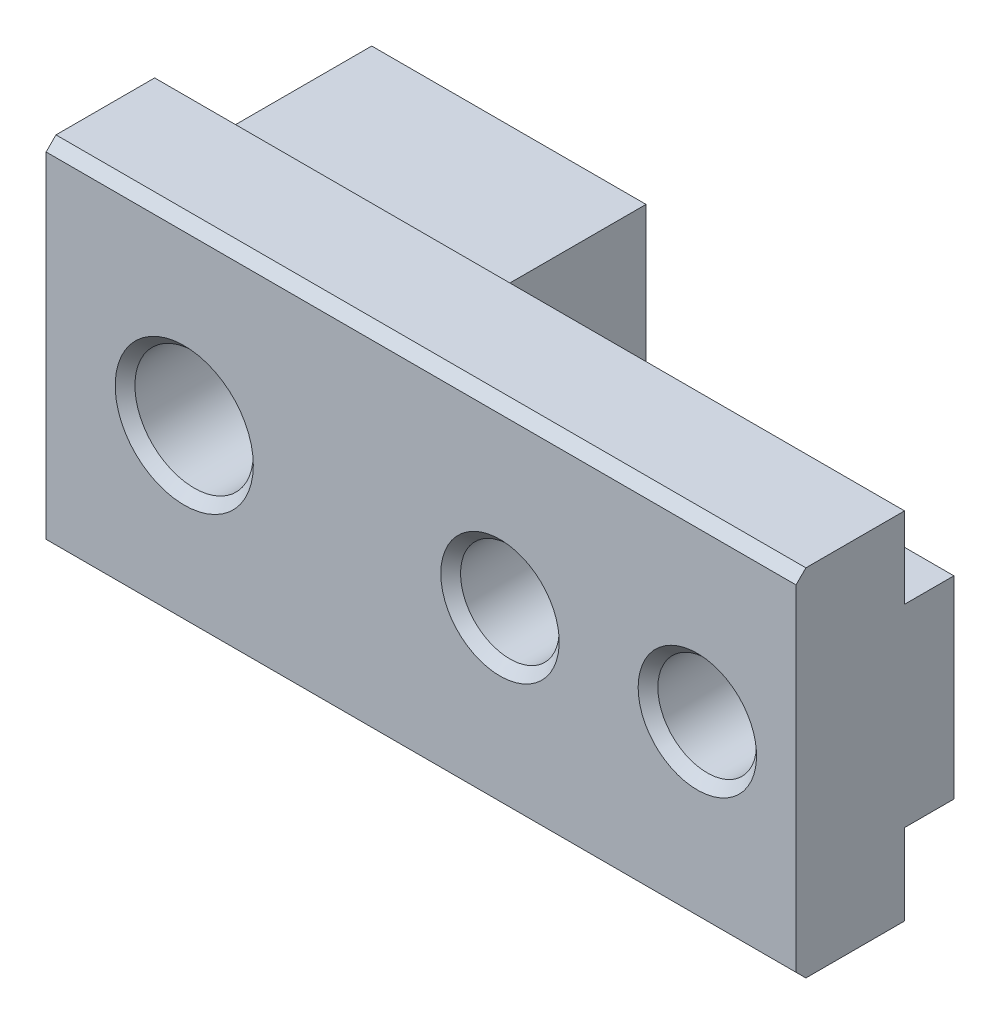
ISO-10303-21;
HEADER;
FILE_DESCRIPTION(('STEP AP214'),'2;1');
FILE_NAME('part.step','',(''),(''),'','','');
FILE_SCHEMA(('AUTOMOTIVE_DESIGN { 1 0 10303 214 1 1 1 1 }'));
ENDSEC;
DATA;
#1=APPLICATION_CONTEXT('core data for automotive mechanical design processes');
#2=APPLICATION_PROTOCOL_DEFINITION('international standard','automotive_design',2000,#1);
#3=PRODUCT_CONTEXT('',#1,'mechanical');
#4=PRODUCT('Part','Part','',(#3));
#5=PRODUCT_RELATED_PRODUCT_CATEGORY('part','',(#4));
#6=PRODUCT_DEFINITION_FORMATION('','',#4);
#7=PRODUCT_DEFINITION_CONTEXT('part definition',#1,'design');
#8=PRODUCT_DEFINITION('design','',#6,#7);
#9=PRODUCT_DEFINITION_SHAPE('','',#8);
#10=(LENGTH_UNIT() NAMED_UNIT(*) SI_UNIT(.MILLI.,.METRE.));
#11=(NAMED_UNIT(*) PLANE_ANGLE_UNIT() SI_UNIT($,.RADIAN.));
#12=(NAMED_UNIT(*) SI_UNIT($,.STERADIAN.) SOLID_ANGLE_UNIT());
#13=UNCERTAINTY_MEASURE_WITH_UNIT(LENGTH_MEASURE(1.E-05),#10,'distance_accuracy_value','');
#14=(GEOMETRIC_REPRESENTATION_CONTEXT(3) GLOBAL_UNCERTAINTY_ASSIGNED_CONTEXT((#13)) GLOBAL_UNIT_ASSIGNED_CONTEXT((#10,
#11,#12)) REPRESENTATION_CONTEXT('',''));
#15=CARTESIAN_POINT('',(0.,0.,0.));
#16=DIRECTION('',(0.,0.,1.));
#17=DIRECTION('',(1.,0.,0.));
#18=AXIS2_PLACEMENT_3D('',#15,#16,#17);
#19=CARTESIAN_POINT('',(0.,0.,-10.9999999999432));
#20=DIRECTION('',(0.,0.,-1.));
#21=DIRECTION('',(-1.,0.,0.));
#22=AXIS2_PLACEMENT_3D('',#19,#20,#21);
#23=CONICAL_SURFACE('',#22,3.49999999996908,0.785398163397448);
#24=CARTESIAN_POINT('',(0.,0.,-11.0000000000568));
#25=DIRECTION('',(0.,0.,-1.));
#26=DIRECTION('',(-1.,0.,0.));
#27=AXIS2_PLACEMENT_3D('',#24,#25,#26);
#28=CIRCLE('',#27,3.50000000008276);
#29=CARTESIAN_POINT('',(-3.50000000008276,0.,-11.0000000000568));
#30=VERTEX_POINT('',#29);
#31=EDGE_CURVE('E178',#30,#30,#28,.T.);
#32=ORIENTED_EDGE('',*,*,#31,.T.);
#33=EDGE_LOOP('',(#32));
#34=FACE_BOUND('',#33,.T.);
#35=CARTESIAN_POINT('',(0.,0.,-10.5));
#36=DIRECTION('',(0.,0.,1.));
#37=DIRECTION('',(1.,0.,0.));
#38=AXIS2_PLACEMENT_3D('',#35,#36,#37);
#39=CIRCLE('',#38,3.);
#40=CARTESIAN_POINT('',(3.,0.,-10.5));
#41=VERTEX_POINT('',#40);
#42=EDGE_CURVE('E151',#41,#41,#39,.T.);
#43=ORIENTED_EDGE('',*,*,#42,.T.);
#44=EDGE_LOOP('',(#43));
#45=FACE_BOUND('',#44,.T.);
#46=ADVANCED_FACE('F14',(#34,#45),#23,.F.);
#47=CARTESIAN_POINT('',(0.,0.,-11.));
#48=DIRECTION('',(0.,0.,1.));
#49=DIRECTION('',(1.,0.,0.));
#50=AXIS2_PLACEMENT_3D('',#47,#48,#49);
#51=CYLINDRICAL_SURFACE('',#50,3.);
#52=CARTESIAN_POINT('',(0.,0.,5.00000000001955));
#53=DIRECTION('',(0.,0.,1.));
#54=DIRECTION('',(1.,0.,0.));
#55=AXIS2_PLACEMENT_3D('',#52,#53,#54);
#56=CIRCLE('',#55,3.00000000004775);
#57=CARTESIAN_POINT('',(3.00000000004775,0.,5.00000000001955));
#58=VERTEX_POINT('',#57);
#59=EDGE_CURVE('E163',#58,#58,#56,.T.);
#60=ORIENTED_EDGE('',*,*,#59,.T.);
#61=EDGE_LOOP('',(#60));
#62=FACE_BOUND('',#61,.T.);
#63=ORIENTED_EDGE('',*,*,#42,.F.);
#64=EDGE_LOOP('',(#63));
#65=FACE_BOUND('',#64,.T.);
#66=ADVANCED_FACE('F316',(#62,#65),#51,.F.);
#67=CARTESIAN_POINT('',(7.1,-4.9,-11.));
#68=DIRECTION('',(0.,0.,1.));
#69=DIRECTION('',(1.,0.,0.));
#70=AXIS2_PLACEMENT_3D('',#67,#68,#69);
#71=PLANE('',#70);
#72=DIRECTION('',(1.,0.,0.));
#73=VECTOR('',#72,1.);
#74=CARTESIAN_POINT('',(7.1,4.9,-11.));
#75=LINE('',#74,#73);
#76=CARTESIAN_POINT('',(-7.,4.9,-11.));
#77=VERTEX_POINT('',#76);
#78=CARTESIAN_POINT('',(6.9,4.9,-11.));
#79=VERTEX_POINT('',#78);
#80=EDGE_CURVE('E169',#77,#79,#75,.T.);
#81=ORIENTED_EDGE('',*,*,#80,.T.);
#82=DIRECTION('',(0.,1.,0.));
#83=VECTOR('',#82,1.);
#84=CARTESIAN_POINT('',(6.9,11.9672645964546,-11.));
#85=LINE('',#84,#83);
#86=CARTESIAN_POINT('',(6.9,-4.9,-11.));
#87=VERTEX_POINT('',#86);
#88=EDGE_CURVE('E131',#87,#79,#85,.T.);
#89=ORIENTED_EDGE('',*,*,#88,.F.);
#90=DIRECTION('',(-1.,0.,0.));
#91=VECTOR('',#90,1.);
#92=CARTESIAN_POINT('',(7.1,-4.9,-11.));
#93=LINE('',#92,#91);
#94=CARTESIAN_POINT('',(-7.,-4.9,-11.));
#95=VERTEX_POINT('',#94);
#96=EDGE_CURVE('E174',#87,#95,#93,.T.);
#97=ORIENTED_EDGE('',*,*,#96,.T.);
#98=DIRECTION('',(0.,-1.,0.));
#99=VECTOR('',#98,1.);
#100=CARTESIAN_POINT('',(-7.,-4.9,-11.));
#101=LINE('',#100,#99);
#102=EDGE_CURVE('E156',#77,#95,#101,.T.);
#103=ORIENTED_EDGE('',*,*,#102,.F.);
#104=EDGE_LOOP('',(#81,#89,#97,#103));
#105=FACE_BOUND('',#104,.T.);
#106=ORIENTED_EDGE('',*,*,#31,.F.);
#107=EDGE_LOOP('',(#106));
#108=FACE_BOUND('',#107,.T.);
#109=ADVANCED_FACE('F258',(#105,#108),#71,.F.);
#110=CARTESIAN_POINT('',(7.1,-9.05,0.));
#111=DIRECTION('',(0.,0.,1.));
#112=DIRECTION('',(1.,0.,0.));
#113=AXIS2_PLACEMENT_3D('',#110,#111,#112);
#114=PLANE('',#113);
#115=DIRECTION('',(0.,-1.,0.));
#116=VECTOR('',#115,1.);
#117=CARTESIAN_POINT('',(31.,-9.05,0.));
#118=LINE('',#117,#116);
#119=CARTESIAN_POINT('',(31.,-4.9,0.));
#120=VERTEX_POINT('',#119);
#121=CARTESIAN_POINT('',(31.,-9.,0.));
#122=VERTEX_POINT('',#121);
#123=EDGE_CURVE('E123',#120,#122,#118,.T.);
#124=ORIENTED_EDGE('',*,*,#123,.T.);
#125=DIRECTION('',(-1.,0.,0.));
#126=VECTOR('',#125,1.);
#127=CARTESIAN_POINT('',(7.1,-9.,0.));
#128=LINE('',#127,#126);
#129=CARTESIAN_POINT('',(-7.,-9.,0.));
#130=VERTEX_POINT('',#129);
#131=EDGE_CURVE('E119',#122,#130,#128,.T.);
#132=ORIENTED_EDGE('',*,*,#131,.T.);
#133=DIRECTION('',(0.,-1.,0.));
#134=VECTOR('',#133,1.);
#135=CARTESIAN_POINT('',(-7.,-4.9,0.));
#136=LINE('',#135,#134);
#137=CARTESIAN_POINT('',(-7.,-4.9,0.));
#138=VERTEX_POINT('',#137);
#139=EDGE_CURVE('E105',#138,#130,#136,.T.);
#140=ORIENTED_EDGE('',*,*,#139,.F.);
#141=DIRECTION('',(-1.,0.,0.));
#142=VECTOR('',#141,1.);
#143=CARTESIAN_POINT('',(7.1,-4.9,0.));
#144=LINE('',#143,#142);
#145=EDGE_CURVE('E176',#138,#120,#144,.F.);
#146=ORIENTED_EDGE('',*,*,#145,.T.);
#147=EDGE_LOOP('',(#124,#132,#140,#146));
#148=FACE_BOUND('',#147,.T.);
#149=ADVANCED_FACE('F122',(#148),#114,.F.);
#150=CARTESIAN_POINT('',(7.1,-4.9,-11.));
#151=DIRECTION('',(0.,1.,0.));
#152=DIRECTION('',(-1.,0.,0.));
#153=AXIS2_PLACEMENT_3D('',#150,#151,#152);
#154=PLANE('',#153);
#155=DIRECTION('',(0.,0.,1.));
#156=VECTOR('',#155,1.);
#157=CARTESIAN_POINT('',(6.9,-4.9,-11.));
#158=LINE('',#157,#156);
#159=CARTESIAN_POINT('',(6.9,-4.9,-2.5));
#160=VERTEX_POINT('',#159);
#161=EDGE_CURVE('E136',#87,#160,#158,.T.);
#162=ORIENTED_EDGE('',*,*,#161,.T.);
#163=DIRECTION('',(1.,0.,0.));
#164=VECTOR('',#163,1.);
#165=CARTESIAN_POINT('',(31.1,-4.9,-2.5));
#166=LINE('',#165,#164);
#167=CARTESIAN_POINT('',(31.,-4.9,-2.5));
#168=VERTEX_POINT('',#167);
#169=EDGE_CURVE('E172',#160,#168,#166,.T.);
#170=ORIENTED_EDGE('',*,*,#169,.T.);
#171=DIRECTION('',(0.,0.,1.));
#172=VECTOR('',#171,1.);
#173=CARTESIAN_POINT('',(31.,-4.9,-11.));
#174=LINE('',#173,#172);
#175=EDGE_CURVE('E147',#168,#120,#174,.T.);
#176=ORIENTED_EDGE('',*,*,#175,.T.);
#177=ORIENTED_EDGE('',*,*,#145,.F.);
#178=DIRECTION('',(0.,0.,1.));
#179=VECTOR('',#178,1.);
#180=CARTESIAN_POINT('',(-7.,-4.9,-11.));
#181=LINE('',#180,#179);
#182=EDGE_CURVE('E111',#95,#138,#181,.T.);
#183=ORIENTED_EDGE('',*,*,#182,.F.);
#184=ORIENTED_EDGE('',*,*,#96,.F.);
#185=EDGE_LOOP('',(#162,#170,#176,#177,#183,#184));
#186=FACE_BOUND('',#185,.T.);
#187=ADVANCED_FACE('F263',(#186),#154,.F.);
#188=CARTESIAN_POINT('',(31.1,-4.9,-2.5));
#189=DIRECTION('',(0.,0.,1.));
#190=DIRECTION('',(1.,0.,0.));
#191=AXIS2_PLACEMENT_3D('',#188,#189,#190);
#192=PLANE('',#191);
#193=CARTESIAN_POINT('',(16.,0.,-2.5));
#194=DIRECTION('',(0.,0.,1.));
#195=DIRECTION('',(1.,0.,0.));
#196=AXIS2_PLACEMENT_3D('',#193,#194,#195);
#197=CIRCLE('',#196,3.);
#198=CARTESIAN_POINT('',(19.,0.,-2.5));
#199=VERTEX_POINT('',#198);
#200=EDGE_CURVE('E201',#199,#199,#197,.T.);
#201=ORIENTED_EDGE('',*,*,#200,.T.);
#202=EDGE_LOOP('',(#201));
#203=FACE_BOUND('',#202,.T.);
#204=CARTESIAN_POINT('',(26.,0.,-2.5));
#205=DIRECTION('',(0.,0.,1.));
#206=DIRECTION('',(1.,0.,0.));
#207=AXIS2_PLACEMENT_3D('',#204,#205,#206);
#208=CIRCLE('',#207,3.);
#209=CARTESIAN_POINT('',(29.,0.,-2.5));
#210=VERTEX_POINT('',#209);
#211=EDGE_CURVE('E198',#210,#210,#208,.T.);
#212=ORIENTED_EDGE('',*,*,#211,.T.);
#213=EDGE_LOOP('',(#212));
#214=FACE_BOUND('',#213,.T.);
#215=DIRECTION('',(0.,-1.,0.));
#216=VECTOR('',#215,1.);
#217=CARTESIAN_POINT('',(31.,-4.9,-2.5));
#218=LINE('',#217,#216);
#219=CARTESIAN_POINT('',(31.,4.9,-2.5));
#220=VERTEX_POINT('',#219);
#221=EDGE_CURVE('E144',#220,#168,#218,.T.);
#222=ORIENTED_EDGE('',*,*,#221,.T.);
#223=ORIENTED_EDGE('',*,*,#169,.F.);
#224=DIRECTION('',(0.,1.,0.));
#225=VECTOR('',#224,1.);
#226=CARTESIAN_POINT('',(6.9,11.9672645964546,-2.5));
#227=LINE('',#226,#225);
#228=CARTESIAN_POINT('',(6.9,4.9,-2.5));
#229=VERTEX_POINT('',#228);
#230=EDGE_CURVE('E133',#160,#229,#227,.T.);
#231=ORIENTED_EDGE('',*,*,#230,.T.);
#232=DIRECTION('',(1.,0.,0.));
#233=VECTOR('',#232,1.);
#234=CARTESIAN_POINT('',(7.1,4.9,-2.5));
#235=LINE('',#234,#233);
#236=EDGE_CURVE('E167',#229,#220,#235,.T.);
#237=ORIENTED_EDGE('',*,*,#236,.T.);
#238=EDGE_LOOP('',(#222,#223,#231,#237));
#239=FACE_BOUND('',#238,.T.);
#240=ADVANCED_FACE('F266',(#203,#214,#239),#192,.F.);
#241=CARTESIAN_POINT('',(7.1,4.9,-11.));
#242=DIRECTION('',(0.,-1.,0.));
#243=DIRECTION('',(1.,0.,0.));
#244=AXIS2_PLACEMENT_3D('',#241,#242,#243);
#245=PLANE('',#244);
#246=ORIENTED_EDGE('',*,*,#236,.F.);
#247=DIRECTION('',(0.,0.,-1.));
#248=VECTOR('',#247,1.);
#249=CARTESIAN_POINT('',(6.9,4.9,-11.));
#250=LINE('',#249,#248);
#251=EDGE_CURVE('E213',#229,#79,#250,.T.);
#252=ORIENTED_EDGE('',*,*,#251,.T.);
#253=ORIENTED_EDGE('',*,*,#80,.F.);
#254=DIRECTION('',(0.,0.,1.));
#255=VECTOR('',#254,1.);
#256=CARTESIAN_POINT('',(-7.,4.9,-11.));
#257=LINE('',#256,#255);
#258=CARTESIAN_POINT('',(-7.,4.9,0.));
#259=VERTEX_POINT('',#258);
#260=EDGE_CURVE('E158',#259,#77,#257,.F.);
#261=ORIENTED_EDGE('',*,*,#260,.F.);
#262=DIRECTION('',(1.,0.,0.));
#263=VECTOR('',#262,1.);
#264=CARTESIAN_POINT('',(7.1,4.9,0.));
#265=LINE('',#264,#263);
#266=CARTESIAN_POINT('',(31.,4.9,0.));
#267=VERTEX_POINT('',#266);
#268=EDGE_CURVE('E164',#259,#267,#265,.T.);
#269=ORIENTED_EDGE('',*,*,#268,.T.);
#270=DIRECTION('',(0.,0.,-1.));
#271=VECTOR('',#270,1.);
#272=CARTESIAN_POINT('',(31.,4.9,-11.));
#273=LINE('',#272,#271);
#274=EDGE_CURVE('E141',#267,#220,#273,.T.);
#275=ORIENTED_EDGE('',*,*,#274,.T.);
#276=EDGE_LOOP('',(#246,#252,#253,#261,#269,#275));
#277=FACE_BOUND('',#276,.T.);
#278=ADVANCED_FACE('F269',(#277),#245,.F.);
#279=CARTESIAN_POINT('',(7.1,4.9,0.));
#280=DIRECTION('',(0.,0.,1.));
#281=DIRECTION('',(1.,0.,0.));
#282=AXIS2_PLACEMENT_3D('',#279,#280,#281);
#283=PLANE('',#282);
#284=ORIENTED_EDGE('',*,*,#268,.F.);
#285=DIRECTION('',(0.,-1.,0.));
#286=VECTOR('',#285,1.);
#287=CARTESIAN_POINT('',(-7.,-4.9,0.));
#288=LINE('',#287,#286);
#289=CARTESIAN_POINT('',(-7.,9.,0.));
#290=VERTEX_POINT('',#289);
#291=EDGE_CURVE('E161',#290,#259,#288,.T.);
#292=ORIENTED_EDGE('',*,*,#291,.F.);
#293=DIRECTION('',(1.,0.,0.));
#294=VECTOR('',#293,1.);
#295=CARTESIAN_POINT('',(7.1,9.,0.));
#296=LINE('',#295,#294);
#297=CARTESIAN_POINT('',(31.,9.,0.));
#298=VERTEX_POINT('',#297);
#299=EDGE_CURVE('E126',#290,#298,#296,.T.);
#300=ORIENTED_EDGE('',*,*,#299,.T.);
#301=DIRECTION('',(0.,-1.,0.));
#302=VECTOR('',#301,1.);
#303=CARTESIAN_POINT('',(31.,4.9,0.));
#304=LINE('',#303,#302);
#305=EDGE_CURVE('E139',#298,#267,#304,.T.);
#306=ORIENTED_EDGE('',*,*,#305,.T.);
#307=EDGE_LOOP('',(#284,#292,#300,#306));
#308=FACE_BOUND('',#307,.T.);
#309=ADVANCED_FACE('F252',(#308),#283,.F.);
#310=CARTESIAN_POINT('',(0.,0.,5.4999999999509));
#311=DIRECTION('',(0.,0.,1.));
#312=DIRECTION('',(1.,0.,0.));
#313=AXIS2_PLACEMENT_3D('',#310,#311,#312);
#314=CONICAL_SURFACE('',#313,3.49999999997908,0.785398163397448);
#315=CARTESIAN_POINT('',(0.,0.,5.50000000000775));
#316=DIRECTION('',(0.,0.,1.));
#317=DIRECTION('',(1.,0.,0.));
#318=AXIS2_PLACEMENT_3D('',#315,#316,#317);
#319=CIRCLE('',#318,3.50000000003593);
#320=CARTESIAN_POINT('',(3.50000000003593,0.,5.50000000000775));
#321=VERTEX_POINT('',#320);
#322=EDGE_CURVE('E115',#321,#321,#319,.T.);
#323=ORIENTED_EDGE('',*,*,#322,.T.);
#324=EDGE_LOOP('',(#323));
#325=FACE_BOUND('',#324,.T.);
#326=ORIENTED_EDGE('',*,*,#59,.F.);
#327=EDGE_LOOP('',(#326));
#328=FACE_BOUND('',#327,.T.);
#329=ADVANCED_FACE('F295',(#325,#328),#314,.F.);
#330=CARTESIAN_POINT('',(-7.,-4.9,-11.));
#331=DIRECTION('',(-1.,0.,0.));
#332=DIRECTION('',(0.,-1.,0.));
#333=AXIS2_PLACEMENT_3D('',#330,#331,#332);
#334=PLANE('',#333);
#335=DIRECTION('',(0.,0.,1.));
#336=VECTOR('',#335,1.);
#337=CARTESIAN_POINT('',(-7.,-9.,6.2030600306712));
#338=LINE('',#337,#336);
#339=CARTESIAN_POINT('',(-7.,-9.,5.));
#340=VERTEX_POINT('',#339);
#341=EDGE_CURVE('E107',#130,#340,#338,.T.);
#342=ORIENTED_EDGE('',*,*,#341,.T.);
#343=DIRECTION('',(0.,-0.707106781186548,-0.707106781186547));
#344=VECTOR('',#343,1.);
#345=CARTESIAN_POINT('',(-7.,-14.95,-0.95));
#346=LINE('',#345,#344);
#347=CARTESIAN_POINT('',(-7.,-8.5,5.5));
#348=VERTEX_POINT('',#347);
#349=EDGE_CURVE('E22',#340,#348,#346,.F.);
#350=ORIENTED_EDGE('',*,*,#349,.T.);
#351=DIRECTION('',(0.,1.,0.));
#352=VECTOR('',#351,1.);
#353=CARTESIAN_POINT('',(-7.,-9.05,5.5));
#354=LINE('',#353,#352);
#355=CARTESIAN_POINT('',(-7.,8.5,5.5));
#356=VERTEX_POINT('',#355);
#357=EDGE_CURVE('E152',#348,#356,#354,.T.);
#358=ORIENTED_EDGE('',*,*,#357,.T.);
#359=DIRECTION('',(0.,-0.707106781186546,0.707106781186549));
#360=VECTOR('',#359,1.);
#361=CARTESIAN_POINT('',(-7.,10.05,3.95));
#362=LINE('',#361,#360);
#363=CARTESIAN_POINT('',(-7.,9.,5.));
#364=VERTEX_POINT('',#363);
#365=EDGE_CURVE('E29',#356,#364,#362,.F.);
#366=ORIENTED_EDGE('',*,*,#365,.T.);
#367=DIRECTION('',(0.,0.,-1.));
#368=VECTOR('',#367,1.);
#369=CARTESIAN_POINT('',(-7.,9.,6.2030600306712));
#370=LINE('',#369,#368);
#371=EDGE_CURVE('E124',#364,#290,#370,.T.);
#372=ORIENTED_EDGE('',*,*,#371,.T.);
#373=ORIENTED_EDGE('',*,*,#291,.T.);
#374=ORIENTED_EDGE('',*,*,#260,.T.);
#375=ORIENTED_EDGE('',*,*,#102,.T.);
#376=ORIENTED_EDGE('',*,*,#182,.T.);
#377=ORIENTED_EDGE('',*,*,#139,.T.);
#378=EDGE_LOOP('',(#342,#350,#358,#366,#372,#373,#374,#375,#376,#377));
#379=FACE_BOUND('',#378,.T.);
#380=ADVANCED_FACE('F106',(#379),#334,.T.);
#381=CARTESIAN_POINT('',(7.1,-9.05,5.5));
#382=DIRECTION('',(0.,0.,-1.));
#383=DIRECTION('',(-1.,0.,0.));
#384=AXIS2_PLACEMENT_3D('',#381,#382,#383);
#385=PLANE('',#384);
#386=CARTESIAN_POINT('',(16.,0.,5.5));
#387=DIRECTION('',(0.,0.,-1.));
#388=DIRECTION('',(-1.,0.,0.));
#389=AXIS2_PLACEMENT_3D('',#386,#387,#388);
#390=CIRCLE('',#389,3.);
#391=CARTESIAN_POINT('',(13.,0.,5.5));
#392=VERTEX_POINT('',#391);
#393=EDGE_CURVE('E189',#392,#392,#390,.T.);
#394=ORIENTED_EDGE('',*,*,#393,.T.);
#395=EDGE_LOOP('',(#394));
#396=FACE_BOUND('',#395,.T.);
#397=CARTESIAN_POINT('',(26.,0.,5.5));
#398=DIRECTION('',(0.,0.,-1.));
#399=DIRECTION('',(-1.,0.,0.));
#400=AXIS2_PLACEMENT_3D('',#397,#398,#399);
#401=CIRCLE('',#400,3.);
#402=CARTESIAN_POINT('',(23.,0.,5.5));
#403=VERTEX_POINT('',#402);
#404=EDGE_CURVE('E153',#403,#403,#401,.T.);
#405=ORIENTED_EDGE('',*,*,#404,.T.);
#406=EDGE_LOOP('',(#405));
#407=FACE_BOUND('',#406,.T.);
#408=ORIENTED_EDGE('',*,*,#357,.F.);
#409=DIRECTION('',(1.,0.,0.));
#410=VECTOR('',#409,1.);
#411=CARTESIAN_POINT('',(7.1,-8.5,5.5));
#412=LINE('',#411,#410);
#413=CARTESIAN_POINT('',(31.,-8.5,5.5));
#414=VERTEX_POINT('',#413);
#415=EDGE_CURVE('E223',#348,#414,#412,.T.);
#416=ORIENTED_EDGE('',*,*,#415,.T.);
#417=DIRECTION('',(0.,1.,0.));
#418=VECTOR('',#417,1.);
#419=CARTESIAN_POINT('',(31.,-9.05,5.5));
#420=LINE('',#419,#418);
#421=CARTESIAN_POINT('',(31.,8.5,5.5));
#422=VERTEX_POINT('',#421);
#423=EDGE_CURVE('E210',#414,#422,#420,.T.);
#424=ORIENTED_EDGE('',*,*,#423,.T.);
#425=DIRECTION('',(-1.,0.,0.));
#426=VECTOR('',#425,1.);
#427=CARTESIAN_POINT('',(7.1,8.5,5.5));
#428=LINE('',#427,#426);
#429=EDGE_CURVE('E221',#422,#356,#428,.T.);
#430=ORIENTED_EDGE('',*,*,#429,.T.);
#431=EDGE_LOOP('',(#408,#416,#424,#430));
#432=FACE_BOUND('',#431,.T.);
#433=ORIENTED_EDGE('',*,*,#322,.F.);
#434=EDGE_LOOP('',(#433));
#435=FACE_BOUND('',#434,.T.);
#436=ADVANCED_FACE('F235',(#396,#407,#432,#435),#385,.F.);
#437=CARTESIAN_POINT('',(26.,0.,7.5));
#438=DIRECTION('',(0.,0.,-1.));
#439=DIRECTION('',(-1.,0.,0.));
#440=AXIS2_PLACEMENT_3D('',#437,#438,#439);
#441=CYLINDRICAL_SURFACE('',#440,2.5);
#442=CARTESIAN_POINT('',(26.,0.,5.));
#443=DIRECTION('',(0.,0.,-1.));
#444=DIRECTION('',(-1.,0.,0.));
#445=AXIS2_PLACEMENT_3D('',#442,#443,#444);
#446=CIRCLE('',#445,2.5);
#447=CARTESIAN_POINT('',(23.5,0.,5.));
#448=VERTEX_POINT('',#447);
#449=EDGE_CURVE('E207',#448,#448,#446,.F.);
#450=ORIENTED_EDGE('',*,*,#449,.T.);
#451=EDGE_LOOP('',(#450));
#452=FACE_BOUND('',#451,.T.);
#453=CARTESIAN_POINT('',(26.,0.,-2.));
#454=DIRECTION('',(0.,0.,1.));
#455=DIRECTION('',(1.,0.,0.));
#456=AXIS2_PLACEMENT_3D('',#453,#454,#455);
#457=CIRCLE('',#456,2.5);
#458=CARTESIAN_POINT('',(28.5,0.,-2.));
#459=VERTEX_POINT('',#458);
#460=EDGE_CURVE('E204',#459,#459,#457,.F.);
#461=ORIENTED_EDGE('',*,*,#460,.T.);
#462=EDGE_LOOP('',(#461));
#463=FACE_BOUND('',#462,.T.);
#464=ADVANCED_FACE('F284',(#452,#463),#441,.F.);
#465=CARTESIAN_POINT('',(16.,0.,7.5));
#466=DIRECTION('',(0.,0.,-1.));
#467=DIRECTION('',(-1.,0.,0.));
#468=AXIS2_PLACEMENT_3D('',#465,#466,#467);
#469=CYLINDRICAL_SURFACE('',#468,2.5);
#470=CARTESIAN_POINT('',(16.,0.,5.));
#471=DIRECTION('',(0.,0.,-1.));
#472=DIRECTION('',(-1.,0.,0.));
#473=AXIS2_PLACEMENT_3D('',#470,#471,#472);
#474=CIRCLE('',#473,2.5);
#475=CARTESIAN_POINT('',(13.5,0.,5.));
#476=VERTEX_POINT('',#475);
#477=EDGE_CURVE('E195',#476,#476,#474,.F.);
#478=ORIENTED_EDGE('',*,*,#477,.T.);
#479=EDGE_LOOP('',(#478));
#480=FACE_BOUND('',#479,.T.);
#481=CARTESIAN_POINT('',(16.,0.,-2.));
#482=DIRECTION('',(0.,0.,1.));
#483=DIRECTION('',(1.,0.,0.));
#484=AXIS2_PLACEMENT_3D('',#481,#482,#483);
#485=CIRCLE('',#484,2.5);
#486=CARTESIAN_POINT('',(18.5,0.,-2.));
#487=VERTEX_POINT('',#486);
#488=EDGE_CURVE('E192',#487,#487,#485,.F.);
#489=ORIENTED_EDGE('',*,*,#488,.T.);
#490=EDGE_LOOP('',(#489));
#491=FACE_BOUND('',#490,.T.);
#492=ADVANCED_FACE('F292',(#480,#491),#469,.F.);
#493=CARTESIAN_POINT('',(16.,0.,5.5));
#494=DIRECTION('',(0.,0.,1.));
#495=DIRECTION('',(1.,0.,0.));
#496=AXIS2_PLACEMENT_3D('',#493,#494,#495);
#497=CONICAL_SURFACE('',#496,3.,0.78539816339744);
#498=ORIENTED_EDGE('',*,*,#477,.F.);
#499=EDGE_LOOP('',(#498));
#500=FACE_BOUND('',#499,.T.);
#501=ORIENTED_EDGE('',*,*,#393,.F.);
#502=EDGE_LOOP('',(#501));
#503=FACE_BOUND('',#502,.T.);
#504=ADVANCED_FACE('F323',(#500,#503),#497,.F.);
#505=CARTESIAN_POINT('',(16.,0.,-2.));
#506=DIRECTION('',(0.,0.,-1.));
#507=DIRECTION('',(-1.,0.,0.));
#508=AXIS2_PLACEMENT_3D('',#505,#506,#507);
#509=CONICAL_SURFACE('',#508,2.5,0.785398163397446);
#510=ORIENTED_EDGE('',*,*,#200,.F.);
#511=EDGE_LOOP('',(#510));
#512=FACE_BOUND('',#511,.T.);
#513=ORIENTED_EDGE('',*,*,#488,.F.);
#514=EDGE_LOOP('',(#513));
#515=FACE_BOUND('',#514,.T.);
#516=ADVANCED_FACE('F326',(#512,#515),#509,.F.);
#517=CARTESIAN_POINT('',(26.,0.,5.5));
#518=DIRECTION('',(0.,0.,1.));
#519=DIRECTION('',(1.,0.,0.));
#520=AXIS2_PLACEMENT_3D('',#517,#518,#519);
#521=CONICAL_SURFACE('',#520,3.,0.78539816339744);
#522=ORIENTED_EDGE('',*,*,#449,.F.);
#523=EDGE_LOOP('',(#522));
#524=FACE_BOUND('',#523,.T.);
#525=ORIENTED_EDGE('',*,*,#404,.F.);
#526=EDGE_LOOP('',(#525));
#527=FACE_BOUND('',#526,.T.);
#528=ADVANCED_FACE('F330',(#524,#527),#521,.F.);
#529=CARTESIAN_POINT('',(26.,0.,-2.));
#530=DIRECTION('',(0.,0.,-1.));
#531=DIRECTION('',(-1.,0.,0.));
#532=AXIS2_PLACEMENT_3D('',#529,#530,#531);
#533=CONICAL_SURFACE('',#532,2.5,0.785398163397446);
#534=ORIENTED_EDGE('',*,*,#211,.F.);
#535=EDGE_LOOP('',(#534));
#536=FACE_BOUND('',#535,.T.);
#537=ORIENTED_EDGE('',*,*,#460,.F.);
#538=EDGE_LOOP('',(#537));
#539=FACE_BOUND('',#538,.T.);
#540=ADVANCED_FACE('F281',(#536,#539),#533,.F.);
#541=CARTESIAN_POINT('',(31.,11.7719377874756,-4.5));
#542=DIRECTION('',(-1.,0.,0.));
#543=DIRECTION('',(0.,-1.,0.));
#544=AXIS2_PLACEMENT_3D('',#541,#542,#543);
#545=PLANE('',#544);
#546=ORIENTED_EDGE('',*,*,#423,.F.);
#547=DIRECTION('',(0.,0.707106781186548,0.707106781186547));
#548=VECTOR('',#547,1.);
#549=CARTESIAN_POINT('',(31.,-8.5,5.5));
#550=LINE('',#549,#548);
#551=CARTESIAN_POINT('',(31.,-9.,5.));
#552=VERTEX_POINT('',#551);
#553=EDGE_CURVE('E228',#414,#552,#550,.F.);
#554=ORIENTED_EDGE('',*,*,#553,.T.);
#555=DIRECTION('',(0.,0.,-1.));
#556=VECTOR('',#555,1.);
#557=CARTESIAN_POINT('',(31.,-9.,-4.5));
#558=LINE('',#557,#556);
#559=EDGE_CURVE('E219',#552,#122,#558,.T.);
#560=ORIENTED_EDGE('',*,*,#559,.T.);
#561=ORIENTED_EDGE('',*,*,#123,.F.);
#562=ORIENTED_EDGE('',*,*,#175,.F.);
#563=ORIENTED_EDGE('',*,*,#221,.F.);
#564=ORIENTED_EDGE('',*,*,#274,.F.);
#565=ORIENTED_EDGE('',*,*,#305,.F.);
#566=DIRECTION('',(0.,0.,1.));
#567=VECTOR('',#566,1.);
#568=CARTESIAN_POINT('',(31.,9.,-4.5));
#569=LINE('',#568,#567);
#570=CARTESIAN_POINT('',(31.,9.,5.));
#571=VERTEX_POINT('',#570);
#572=EDGE_CURVE('E216',#298,#571,#569,.T.);
#573=ORIENTED_EDGE('',*,*,#572,.T.);
#574=DIRECTION('',(0.,0.707106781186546,-0.707106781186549));
#575=VECTOR('',#574,1.);
#576=CARTESIAN_POINT('',(31.,9.,5.));
#577=LINE('',#576,#575);
#578=EDGE_CURVE('E226',#571,#422,#577,.F.);
#579=ORIENTED_EDGE('',*,*,#578,.T.);
#580=EDGE_LOOP('',(#546,#554,#560,#561,#562,#563,#564,#565,#573,#579));
#581=FACE_BOUND('',#580,.T.);
#582=ADVANCED_FACE('F241',(#581),#545,.F.);
#583=CARTESIAN_POINT('',(6.9,11.9672645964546,20.8498969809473));
#584=DIRECTION('',(-1.,0.,0.));
#585=DIRECTION('',(0.,-1.,0.));
#586=AXIS2_PLACEMENT_3D('',#583,#584,#585);
#587=PLANE('',#586);
#588=ORIENTED_EDGE('',*,*,#88,.T.);
#589=ORIENTED_EDGE('',*,*,#251,.F.);
#590=ORIENTED_EDGE('',*,*,#230,.F.);
#591=ORIENTED_EDGE('',*,*,#161,.F.);
#592=EDGE_LOOP('',(#588,#589,#590,#591));
#593=FACE_BOUND('',#592,.T.);
#594=ADVANCED_FACE('F271',(#593),#587,.F.);
#595=CARTESIAN_POINT('',(-14.4718510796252,9.,6.2030600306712));
#596=DIRECTION('',(0.,-1.,0.));
#597=DIRECTION('',(1.,0.,0.));
#598=AXIS2_PLACEMENT_3D('',#595,#596,#597);
#599=PLANE('',#598);
#600=ORIENTED_EDGE('',*,*,#371,.F.);
#601=DIRECTION('',(1.,0.,0.));
#602=VECTOR('',#601,1.);
#603=CARTESIAN_POINT('',(-14.4718510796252,9.,5.));
#604=LINE('',#603,#602);
#605=EDGE_CURVE('E9',#364,#571,#604,.T.);
#606=ORIENTED_EDGE('',*,*,#605,.T.);
#607=ORIENTED_EDGE('',*,*,#572,.F.);
#608=ORIENTED_EDGE('',*,*,#299,.F.);
#609=EDGE_LOOP('',(#600,#606,#607,#608));
#610=FACE_BOUND('',#609,.T.);
#611=ADVANCED_FACE('F245',(#610),#599,.F.);
#612=CARTESIAN_POINT('',(-14.4718510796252,-9.,6.2030600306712));
#613=DIRECTION('',(0.,1.,0.));
#614=DIRECTION('',(-1.,0.,0.));
#615=AXIS2_PLACEMENT_3D('',#612,#613,#614);
#616=PLANE('',#615);
#617=ORIENTED_EDGE('',*,*,#559,.F.);
#618=DIRECTION('',(-1.,0.,0.));
#619=VECTOR('',#618,1.);
#620=CARTESIAN_POINT('',(-14.4718510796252,-9.,5.));
#621=LINE('',#620,#619);
#622=EDGE_CURVE('E37',#552,#340,#621,.T.);
#623=ORIENTED_EDGE('',*,*,#622,.T.);
#624=ORIENTED_EDGE('',*,*,#341,.F.);
#625=ORIENTED_EDGE('',*,*,#131,.F.);
#626=EDGE_LOOP('',(#617,#623,#624,#625));
#627=FACE_BOUND('',#626,.T.);
#628=ADVANCED_FACE('F118',(#627),#616,.F.);
#629=CARTESIAN_POINT('',(7.1,-8.5,5.5));
#630=DIRECTION('',(0.,0.707106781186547,-0.707106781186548));
#631=DIRECTION('',(1.,0.,0.));
#632=AXIS2_PLACEMENT_3D('',#629,#630,#631);
#633=PLANE('',#632);
#634=ORIENTED_EDGE('',*,*,#349,.F.);
#635=ORIENTED_EDGE('',*,*,#622,.F.);
#636=ORIENTED_EDGE('',*,*,#553,.F.);
#637=ORIENTED_EDGE('',*,*,#415,.F.);
#638=EDGE_LOOP('',(#634,#635,#636,#637));
#639=FACE_BOUND('',#638,.T.);
#640=ADVANCED_FACE('F239',(#639),#633,.F.);
#641=CARTESIAN_POINT('',(-14.4718510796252,9.,5.));
#642=DIRECTION('',(0.,-0.707106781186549,-0.707106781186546));
#643=DIRECTION('',(1.,0.,0.));
#644=AXIS2_PLACEMENT_3D('',#641,#642,#643);
#645=PLANE('',#644);
#646=ORIENTED_EDGE('',*,*,#365,.F.);
#647=ORIENTED_EDGE('',*,*,#429,.F.);
#648=ORIENTED_EDGE('',*,*,#578,.F.);
#649=ORIENTED_EDGE('',*,*,#605,.F.);
#650=EDGE_LOOP('',(#646,#647,#648,#649));
#651=FACE_BOUND('',#650,.T.);
#652=ADVANCED_FACE('F16',(#651),#645,.F.);
#653=CLOSED_SHELL('',(#46,#66,#109,#149,#187,#240,#278,#309,#329,#380,#436,#464,#492,#504,#516,
#528,#540,#582,#594,#611,#628,#640,#652));
#654=MANIFOLD_SOLID_BREP('B1',#653);
#655=ADVANCED_BREP_SHAPE_REPRESENTATION('',(#18,#654),#14);
#656=SHAPE_DEFINITION_REPRESENTATION(#9,#655);
ENDSEC;
END-ISO-10303-21;
